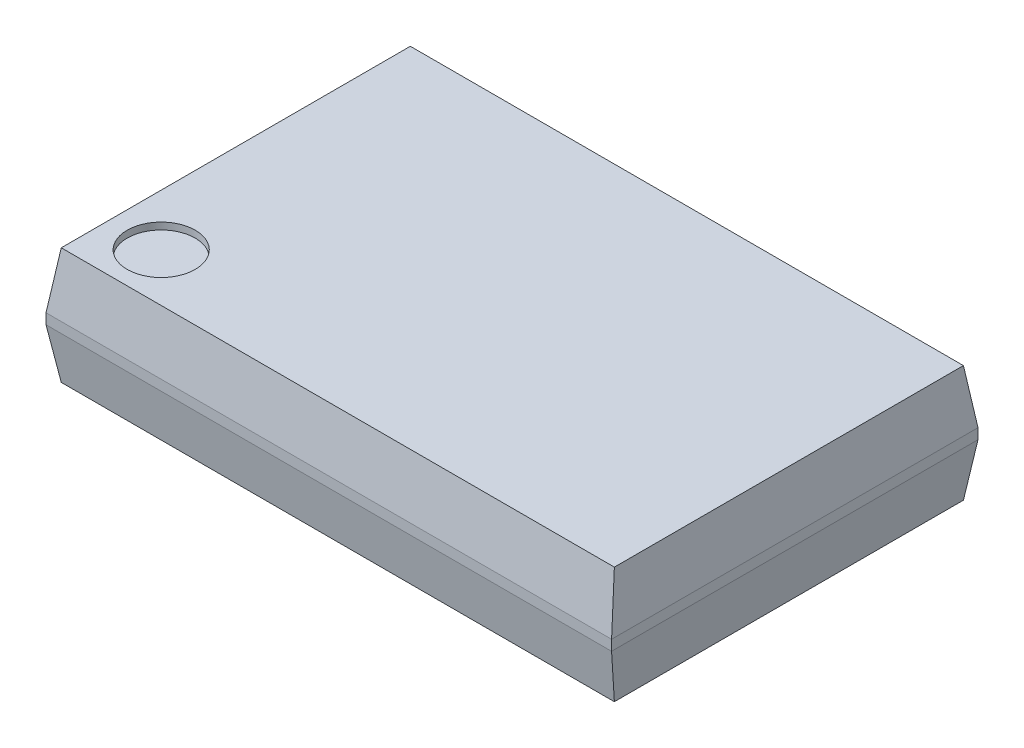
ISO-10303-21;
HEADER;
FILE_DESCRIPTION(('STEP AP214'),'2;1');
FILE_NAME('part.step','',(''),(''),'','','');
FILE_SCHEMA(('AUTOMOTIVE_DESIGN { 1 0 10303 214 1 1 1 1 }'));
ENDSEC;
DATA;
#1=APPLICATION_CONTEXT('core data for automotive mechanical design processes');
#2=APPLICATION_PROTOCOL_DEFINITION('international standard','automotive_design',2000,#1);
#3=PRODUCT_CONTEXT('',#1,'mechanical');
#4=PRODUCT('Part','Part','',(#3));
#5=PRODUCT_RELATED_PRODUCT_CATEGORY('part','',(#4));
#6=PRODUCT_DEFINITION_FORMATION('','',#4);
#7=PRODUCT_DEFINITION_CONTEXT('part definition',#1,'design');
#8=PRODUCT_DEFINITION('design','',#6,#7);
#9=PRODUCT_DEFINITION_SHAPE('','',#8);
#10=(LENGTH_UNIT() NAMED_UNIT(*) SI_UNIT(.MILLI.,.METRE.));
#11=(NAMED_UNIT(*) PLANE_ANGLE_UNIT() SI_UNIT($,.RADIAN.));
#12=(NAMED_UNIT(*) SI_UNIT($,.STERADIAN.) SOLID_ANGLE_UNIT());
#13=UNCERTAINTY_MEASURE_WITH_UNIT(LENGTH_MEASURE(1.E-05),#10,'distance_accuracy_value','');
#14=(GEOMETRIC_REPRESENTATION_CONTEXT(3) GLOBAL_UNCERTAINTY_ASSIGNED_CONTEXT((#13)) GLOBAL_UNIT_ASSIGNED_CONTEXT((#10,
#11,#12)) REPRESENTATION_CONTEXT('',''));
#15=CARTESIAN_POINT('',(0.,0.,0.));
#16=DIRECTION('',(0.,0.,1.));
#17=DIRECTION('',(1.,0.,0.));
#18=AXIS2_PLACEMENT_3D('',#15,#16,#17);
#19=CARTESIAN_POINT('',(-2.77777777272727,0.848106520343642,1.83333333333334));
#20=DIRECTION('',(0.,1.,0.));
#21=DIRECTION('',(-1.,0.,0.));
#22=AXIS2_PLACEMENT_3D('',#19,#20,#21);
#23=PLANE('',#22);
#24=CARTESIAN_POINT('',(-3.27272727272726,0.848106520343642,1.83333333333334));
#25=DIRECTION('',(0.,1.,0.));
#26=DIRECTION('',(-1.,0.,0.));
#27=AXIS2_PLACEMENT_3D('',#24,#25,#26);
#28=CIRCLE('',#27,0.49494949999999);
#29=CARTESIAN_POINT('',(-3.76767677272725,0.848106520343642,1.83333333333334));
#30=VERTEX_POINT('',#29);
#31=EDGE_CURVE('E19',#30,#30,#28,.T.);
#32=ORIENTED_EDGE('',*,*,#31,.T.);
#33=EDGE_LOOP('',(#32));
#34=FACE_BOUND('',#33,.T.);
#35=ADVANCED_FACE('F16',(#34),#23,.T.);
#36=CARTESIAN_POINT('',(-3.27272727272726,0.948106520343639,1.83333333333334));
#37=DIRECTION('',(0.,1.,0.));
#38=DIRECTION('',(-1.,0.,0.));
#39=AXIS2_PLACEMENT_3D('',#36,#37,#38);
#40=CYLINDRICAL_SURFACE('',#39,0.49494949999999);
#41=CARTESIAN_POINT('',(-3.27272727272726,0.948106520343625,1.83333333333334));
#42=DIRECTION('',(0.,1.,0.));
#43=DIRECTION('',(-1.,0.,0.));
#44=AXIS2_PLACEMENT_3D('',#41,#42,#43);
#45=CIRCLE('',#44,0.49494949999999);
#46=CARTESIAN_POINT('',(-3.76767677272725,0.948106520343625,1.83333333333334));
#47=VERTEX_POINT('',#46);
#48=EDGE_CURVE('E92',#47,#47,#45,.F.);
#49=ORIENTED_EDGE('',*,*,#48,.F.);
#50=EDGE_LOOP('',(#49));
#51=FACE_BOUND('',#50,.T.);
#52=ORIENTED_EDGE('',*,*,#31,.F.);
#53=EDGE_LOOP('',(#52));
#54=FACE_BOUND('',#53,.T.);
#55=ADVANCED_FACE('F113',(#51,#54),#40,.F.);
#56=CARTESIAN_POINT('',(-4.11614999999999,0.948106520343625,-0.00505050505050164));
#57=DIRECTION('',(0.,1.,0.));
#58=DIRECTION('',(0.,0.,1.));
#59=AXIS2_PLACEMENT_3D('',#56,#57,#58);
#60=PLANE('',#59);
#61=DIRECTION('',(0.,0.,1.));
#62=VECTOR('',#61,1.);
#63=CARTESIAN_POINT('',(4.02524090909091,0.948106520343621,-4.11615000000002));
#64=LINE('',#63,#62);
#65=CARTESIAN_POINT('',(4.02524090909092,0.948106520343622,2.53535353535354));
#66=VERTEX_POINT('',#65);
#67=CARTESIAN_POINT('',(4.02524090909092,0.94810652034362,-2.54545454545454));
#68=VERTEX_POINT('',#67);
#69=EDGE_CURVE('E79',#66,#68,#64,.F.);
#70=ORIENTED_EDGE('',*,*,#69,.T.);
#71=DIRECTION('',(1.,0.,0.));
#72=VECTOR('',#71,1.);
#73=CARTESIAN_POINT('',(-4.11614999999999,0.948106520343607,-2.54545454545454));
#74=LINE('',#73,#72);
#75=CARTESIAN_POINT('',(-4.02524090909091,0.948106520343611,-2.54545454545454));
#76=VERTEX_POINT('',#75);
#77=EDGE_CURVE('E94',#76,#68,#74,.T.);
#78=ORIENTED_EDGE('',*,*,#77,.F.);
#79=DIRECTION('',(0.,0.,1.));
#80=VECTOR('',#79,1.);
#81=CARTESIAN_POINT('',(-4.0252409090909,0.948106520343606,-4.11615000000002));
#82=LINE('',#81,#80);
#83=CARTESIAN_POINT('',(-4.02524090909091,0.948106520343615,2.53535353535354));
#84=VERTEX_POINT('',#83);
#85=EDGE_CURVE('E84',#76,#84,#82,.T.);
#86=ORIENTED_EDGE('',*,*,#85,.T.);
#87=DIRECTION('',(1.,0.,0.));
#88=VECTOR('',#87,1.);
#89=CARTESIAN_POINT('',(-4.11614999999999,0.948106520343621,2.53535353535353));
#90=LINE('',#89,#88);
#91=EDGE_CURVE('E358',#66,#84,#90,.F.);
#92=ORIENTED_EDGE('',*,*,#91,.F.);
#93=EDGE_LOOP('',(#70,#78,#86,#92));
#94=FACE_BOUND('',#93,.T.);
#95=ORIENTED_EDGE('',*,*,#48,.T.);
#96=EDGE_LOOP('',(#95));
#97=FACE_BOUND('',#96,.T.);
#98=ADVANCED_FACE('F95',(#94,#97),#60,.T.);
#99=CARTESIAN_POINT('',(-4.07069545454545,0.549116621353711,-4.11615000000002));
#100=DIRECTION('',(0.993573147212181,-0.113191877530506,0.));
#101=DIRECTION('',(0.113191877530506,0.993573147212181,0.));
#102=AXIS2_PLACEMENT_3D('',#99,#100,#101);
#103=PLANE('',#102);
#104=DIRECTION('',(0.,0.,-1.));
#105=VECTOR('',#104,1.);
#106=CARTESIAN_POINT('',(-4.11614999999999,0.150126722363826,-0.00373182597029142));
#107=LINE('',#106,#105);
#108=CARTESIAN_POINT('',(-4.11614999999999,0.150126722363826,-2.66666666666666));
#109=VERTEX_POINT('',#108);
#110=CARTESIAN_POINT('',(-4.11614999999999,0.150126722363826,2.66666666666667));
#111=VERTEX_POINT('',#110);
#112=EDGE_CURVE('E356',#109,#111,#107,.F.);
#113=ORIENTED_EDGE('',*,*,#112,.T.);
#114=DIRECTION('',(-0.111708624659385,-0.980553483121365,0.161356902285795));
#115=VECTOR('',#114,1.);
#116=CARTESIAN_POINT('',(-4.02524090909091,0.948106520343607,2.53535353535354));
#117=LINE('',#116,#115);
#118=EDGE_CURVE('E90',#84,#111,#117,.T.);
#119=ORIENTED_EDGE('',*,*,#118,.F.);
#120=ORIENTED_EDGE('',*,*,#85,.F.);
#121=DIRECTION('',(0.11192437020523,0.982447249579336,0.149232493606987));
#122=VECTOR('',#121,1.);
#123=CARTESIAN_POINT('',(-4.11614999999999,0.150126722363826,-2.66666666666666));
#124=LINE('',#123,#122);
#125=EDGE_CURVE('E87',#109,#76,#124,.T.);
#126=ORIENTED_EDGE('',*,*,#125,.F.);
#127=EDGE_LOOP('',(#113,#119,#120,#126));
#128=FACE_BOUND('',#127,.T.);
#129=ADVANCED_FACE('F85',(#128),#103,.F.);
#130=CARTESIAN_POINT('',(-4.11614999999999,0.549116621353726,-2.6060606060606));
#131=DIRECTION('',(0.,0.150176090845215,-0.988659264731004));
#132=DIRECTION('',(0.,0.988659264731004,0.150176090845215));
#133=AXIS2_PLACEMENT_3D('',#130,#131,#132);
#134=PLANE('',#133);
#135=DIRECTION('',(0.111924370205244,-0.982447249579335,-0.149232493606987));
#136=VECTOR('',#135,1.);
#137=CARTESIAN_POINT('',(4.02524090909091,0.948106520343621,-2.54545454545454));
#138=LINE('',#137,#136);
#139=CARTESIAN_POINT('',(4.11615000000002,0.150126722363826,-2.66666666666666));
#140=VERTEX_POINT('',#139);
#141=EDGE_CURVE('E339',#68,#140,#138,.T.);
#142=ORIENTED_EDGE('',*,*,#141,.T.);
#143=DIRECTION('',(-1.,0.,0.));
#144=VECTOR('',#143,1.);
#145=CARTESIAN_POINT('',(-4.11614999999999,0.150126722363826,-2.66666666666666));
#146=LINE('',#145,#144);
#147=EDGE_CURVE('E103',#109,#140,#146,.F.);
#148=ORIENTED_EDGE('',*,*,#147,.F.);
#149=ORIENTED_EDGE('',*,*,#125,.T.);
#150=ORIENTED_EDGE('',*,*,#77,.T.);
#151=EDGE_LOOP('',(#142,#148,#149,#150));
#152=FACE_BOUND('',#151,.T.);
#153=ADVANCED_FACE('F101',(#152),#134,.T.);
#154=CARTESIAN_POINT('',(4.07069545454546,0.549116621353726,-4.11615000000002));
#155=DIRECTION('',(-0.993573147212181,-0.113191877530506,0.));
#156=DIRECTION('',(0.113191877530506,-0.993573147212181,0.));
#157=AXIS2_PLACEMENT_3D('',#154,#155,#156);
#158=PLANE('',#157);
#159=DIRECTION('',(0.,0.,-1.));
#160=VECTOR('',#159,1.);
#161=CARTESIAN_POINT('',(4.11615000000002,0.150126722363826,2.66666666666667));
#162=LINE('',#161,#160);
#163=CARTESIAN_POINT('',(4.11615000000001,0.150126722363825,2.66666666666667));
#164=VERTEX_POINT('',#163);
#165=EDGE_CURVE('E337',#140,#164,#162,.F.);
#166=ORIENTED_EDGE('',*,*,#165,.F.);
#167=ORIENTED_EDGE('',*,*,#141,.F.);
#168=ORIENTED_EDGE('',*,*,#69,.F.);
#169=DIRECTION('',(-0.111708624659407,0.980553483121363,-0.161356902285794));
#170=VECTOR('',#169,1.);
#171=CARTESIAN_POINT('',(4.11615000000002,0.150126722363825,2.66666666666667));
#172=LINE('',#171,#170);
#173=EDGE_CURVE('E341',#164,#66,#172,.T.);
#174=ORIENTED_EDGE('',*,*,#173,.F.);
#175=EDGE_LOOP('',(#166,#167,#168,#174));
#176=FACE_BOUND('',#175,.T.);
#177=ADVANCED_FACE('F164',(#176),#158,.F.);
#178=CARTESIAN_POINT('',(-4.11614999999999,0.549116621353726,2.6010101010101));
#179=DIRECTION('',(0.,0.162373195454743,0.986729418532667));
#180=DIRECTION('',(0.,-0.986729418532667,0.162373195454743));
#181=AXIS2_PLACEMENT_3D('',#178,#179,#180);
#182=PLANE('',#181);
#183=ORIENTED_EDGE('',*,*,#173,.T.);
#184=ORIENTED_EDGE('',*,*,#91,.T.);
#185=ORIENTED_EDGE('',*,*,#118,.T.);
#186=DIRECTION('',(1.,0.,0.));
#187=VECTOR('',#186,1.);
#188=CARTESIAN_POINT('',(-4.11614999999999,0.150126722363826,2.66666666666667));
#189=LINE('',#188,#187);
#190=EDGE_CURVE('E376',#164,#111,#189,.F.);
#191=ORIENTED_EDGE('',*,*,#190,.F.);
#192=EDGE_LOOP('',(#183,#184,#185,#191));
#193=FACE_BOUND('',#192,.T.);
#194=ADVANCED_FACE('F160',(#193),#182,.T.);
#195=CARTESIAN_POINT('',(-4.11614999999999,0.0995384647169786,-0.00373182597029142));
#196=DIRECTION('',(1.,0.,0.));
#197=DIRECTION('',(0.,0.,-1.));
#198=AXIS2_PLACEMENT_3D('',#195,#196,#197);
#199=PLANE('',#198);
#200=DIRECTION('',(0.,1.,0.));
#201=VECTOR('',#200,1.);
#202=CARTESIAN_POINT('',(-4.11614999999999,0.0743691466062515,2.66666666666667));
#203=LINE('',#202,#201);
#204=CARTESIAN_POINT('',(-4.11615,-0.0013884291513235,2.66666666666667));
#205=VERTEX_POINT('',#204);
#206=EDGE_CURVE('E373',#111,#205,#203,.F.);
#207=ORIENTED_EDGE('',*,*,#206,.F.);
#208=ORIENTED_EDGE('',*,*,#112,.F.);
#209=DIRECTION('',(0.,1.,0.));
#210=VECTOR('',#209,1.);
#211=CARTESIAN_POINT('',(-4.11614999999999,0.0743691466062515,-2.66666666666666));
#212=LINE('',#211,#210);
#213=CARTESIAN_POINT('',(-4.11615,-0.00138842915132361,-2.66666666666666));
#214=VERTEX_POINT('',#213);
#215=EDGE_CURVE('E351',#214,#109,#212,.T.);
#216=ORIENTED_EDGE('',*,*,#215,.F.);
#217=DIRECTION('',(0.,0.,1.));
#218=VECTOR('',#217,1.);
#219=CARTESIAN_POINT('',(-4.11615000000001,-0.00138842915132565,-4.11615000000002));
#220=LINE('',#219,#218);
#221=EDGE_CURVE('E366',#214,#205,#220,.T.);
#222=ORIENTED_EDGE('',*,*,#221,.T.);
#223=EDGE_LOOP('',(#207,#208,#216,#222));
#224=FACE_BOUND('',#223,.T.);
#225=ADVANCED_FACE('F156',(#224),#199,.F.);
#226=CARTESIAN_POINT('',(-4.11614999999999,0.0743691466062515,-2.66666666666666));
#227=DIRECTION('',(0.,0.,-1.));
#228=DIRECTION('',(-1.,0.,0.));
#229=AXIS2_PLACEMENT_3D('',#226,#227,#228);
#230=PLANE('',#229);
#231=ORIENTED_EDGE('',*,*,#215,.T.);
#232=ORIENTED_EDGE('',*,*,#147,.T.);
#233=DIRECTION('',(0.,1.,0.));
#234=VECTOR('',#233,1.);
#235=CARTESIAN_POINT('',(4.11615000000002,-0.00138842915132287,-2.66666666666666));
#236=LINE('',#235,#234);
#237=CARTESIAN_POINT('',(4.11615000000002,-0.00138842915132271,-2.66666666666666));
#238=VERTEX_POINT('',#237);
#239=EDGE_CURVE('E344',#238,#140,#236,.T.);
#240=ORIENTED_EDGE('',*,*,#239,.F.);
#241=DIRECTION('',(1.,0.,0.));
#242=VECTOR('',#241,1.);
#243=CARTESIAN_POINT('',(-4.11614999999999,-0.00138842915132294,-2.66666666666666));
#244=LINE('',#243,#242);
#245=EDGE_CURVE('E362',#214,#238,#244,.T.);
#246=ORIENTED_EDGE('',*,*,#245,.F.);
#247=EDGE_LOOP('',(#231,#232,#240,#246));
#248=FACE_BOUND('',#247,.T.);
#249=ADVANCED_FACE('F152',(#248),#230,.T.);
#250=CARTESIAN_POINT('',(4.11615000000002,-0.00138842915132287,2.66666666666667));
#251=DIRECTION('',(1.,0.,0.));
#252=DIRECTION('',(0.,0.,-1.));
#253=AXIS2_PLACEMENT_3D('',#250,#251,#252);
#254=PLANE('',#253);
#255=ORIENTED_EDGE('',*,*,#165,.T.);
#256=DIRECTION('',(0.,1.,0.));
#257=VECTOR('',#256,1.);
#258=CARTESIAN_POINT('',(4.11615000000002,0.0743691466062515,2.66666666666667));
#259=LINE('',#258,#257);
#260=CARTESIAN_POINT('',(4.11615000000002,-0.00138842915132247,2.66666666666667));
#261=VERTEX_POINT('',#260);
#262=EDGE_CURVE('E343',#261,#164,#259,.T.);
#263=ORIENTED_EDGE('',*,*,#262,.F.);
#264=DIRECTION('',(0.,0.,1.));
#265=VECTOR('',#264,1.);
#266=CARTESIAN_POINT('',(4.11615000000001,-0.00138842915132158,-4.11615000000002));
#267=LINE('',#266,#265);
#268=EDGE_CURVE('E347',#261,#238,#267,.F.);
#269=ORIENTED_EDGE('',*,*,#268,.T.);
#270=ORIENTED_EDGE('',*,*,#239,.T.);
#271=EDGE_LOOP('',(#255,#263,#269,#270));
#272=FACE_BOUND('',#271,.T.);
#273=ADVANCED_FACE('F148',(#272),#254,.T.);
#274=CARTESIAN_POINT('',(-4.11614999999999,0.0743691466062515,2.66666666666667));
#275=DIRECTION('',(0.,0.,1.));
#276=DIRECTION('',(1.,0.,0.));
#277=AXIS2_PLACEMENT_3D('',#274,#275,#276);
#278=PLANE('',#277);
#279=ORIENTED_EDGE('',*,*,#206,.T.);
#280=DIRECTION('',(1.,0.,0.));
#281=VECTOR('',#280,1.);
#282=CARTESIAN_POINT('',(-4.11614999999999,-0.00138842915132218,2.66666666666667));
#283=LINE('',#282,#281);
#284=EDGE_CURVE('E384',#261,#205,#283,.F.);
#285=ORIENTED_EDGE('',*,*,#284,.F.);
#286=ORIENTED_EDGE('',*,*,#262,.T.);
#287=ORIENTED_EDGE('',*,*,#190,.T.);
#288=EDGE_LOOP('',(#279,#285,#286,#287));
#289=FACE_BOUND('',#288,.T.);
#290=ADVANCED_FACE('F144',(#289),#278,.T.);
#291=CARTESIAN_POINT('',(-4.07069545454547,-0.375125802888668,-4.11615000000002));
#292=DIRECTION('',(0.992685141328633,0.120731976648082,0.));
#293=DIRECTION('',(-0.120731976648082,0.992685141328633,0.));
#294=AXIS2_PLACEMENT_3D('',#291,#292,#293);
#295=PLANE('',#294);
#296=ORIENTED_EDGE('',*,*,#221,.F.);
#297=DIRECTION('',(-0.119197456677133,0.980067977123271,-0.158929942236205));
#298=VECTOR('',#297,1.);
#299=CARTESIAN_POINT('',(-4.02524090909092,-0.748863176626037,-2.54545454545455));
#300=LINE('',#299,#298);
#301=CARTESIAN_POINT('',(-4.02524090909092,-0.748863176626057,-2.54545454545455));
#302=VERTEX_POINT('',#301);
#303=EDGE_CURVE('E368',#302,#214,#300,.T.);
#304=ORIENTED_EDGE('',*,*,#303,.F.);
#305=DIRECTION('',(0.,0.,-1.));
#306=VECTOR('',#305,1.);
#307=CARTESIAN_POINT('',(-4.02524090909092,-0.74886317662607,-0.00505050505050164));
#308=LINE('',#307,#306);
#309=CARTESIAN_POINT('',(-4.02524090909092,-0.748863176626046,2.53535353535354));
#310=VERTEX_POINT('',#309);
#311=EDGE_CURVE('E393',#310,#302,#308,.T.);
#312=ORIENTED_EDGE('',*,*,#311,.F.);
#313=DIRECTION('',(0.118936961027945,-0.977926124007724,-0.171797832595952));
#314=VECTOR('',#313,1.);
#315=CARTESIAN_POINT('',(-4.11614999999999,-0.00138842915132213,2.66666666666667));
#316=LINE('',#315,#314);
#317=EDGE_CURVE('E371',#205,#310,#316,.T.);
#318=ORIENTED_EDGE('',*,*,#317,.F.);
#319=EDGE_LOOP('',(#296,#304,#312,#318));
#320=FACE_BOUND('',#319,.T.);
#321=ADVANCED_FACE('F140',(#320),#295,.F.);
#322=CARTESIAN_POINT('',(-4.11614999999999,-0.375125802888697,-2.6060606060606));
#323=DIRECTION('',(0.,-0.160071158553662,-0.987105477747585));
#324=DIRECTION('',(0.,0.987105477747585,-0.160071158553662));
#325=AXIS2_PLACEMENT_3D('',#322,#323,#324);
#326=PLANE('',#325);
#327=DIRECTION('',(-0.119197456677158,-0.980067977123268,0.158929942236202));
#328=VECTOR('',#327,1.);
#329=CARTESIAN_POINT('',(4.11615000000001,-0.00138842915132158,-2.66666666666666));
#330=LINE('',#329,#328);
#331=CARTESIAN_POINT('',(4.02524090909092,-0.748863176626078,-2.54545454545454));
#332=VERTEX_POINT('',#331);
#333=EDGE_CURVE('E386',#238,#332,#330,.T.);
#334=ORIENTED_EDGE('',*,*,#333,.T.);
#335=DIRECTION('',(1.,0.,0.));
#336=VECTOR('',#335,1.);
#337=CARTESIAN_POINT('',(-4.11614999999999,-0.74886317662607,-2.54545454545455));
#338=LINE('',#337,#336);
#339=EDGE_CURVE('E396',#302,#332,#338,.T.);
#340=ORIENTED_EDGE('',*,*,#339,.F.);
#341=ORIENTED_EDGE('',*,*,#303,.T.);
#342=ORIENTED_EDGE('',*,*,#245,.T.);
#343=EDGE_LOOP('',(#334,#340,#341,#342));
#344=FACE_BOUND('',#343,.T.);
#345=ADVANCED_FACE('F137',(#344),#326,.T.);
#346=CARTESIAN_POINT('',(4.07069545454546,-0.375125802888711,-4.11615000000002));
#347=DIRECTION('',(-0.992685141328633,0.120731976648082,0.));
#348=DIRECTION('',(-0.120731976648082,-0.992685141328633,0.));
#349=AXIS2_PLACEMENT_3D('',#346,#347,#348);
#350=PLANE('',#349);
#351=ORIENTED_EDGE('',*,*,#268,.F.);
#352=DIRECTION('',(0.118936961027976,0.97792612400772,0.171797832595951));
#353=VECTOR('',#352,1.);
#354=CARTESIAN_POINT('',(4.02524090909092,-0.748863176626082,2.53535353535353));
#355=LINE('',#354,#353);
#356=CARTESIAN_POINT('',(4.02524090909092,-0.748863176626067,2.53535353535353));
#357=VERTEX_POINT('',#356);
#358=EDGE_CURVE('E34',#357,#261,#355,.T.);
#359=ORIENTED_EDGE('',*,*,#358,.F.);
#360=DIRECTION('',(0.,0.,-1.));
#361=VECTOR('',#360,1.);
#362=CARTESIAN_POINT('',(4.02524090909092,-0.74886317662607,-0.00505050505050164));
#363=LINE('',#362,#361);
#364=EDGE_CURVE('E25',#332,#357,#363,.F.);
#365=ORIENTED_EDGE('',*,*,#364,.F.);
#366=ORIENTED_EDGE('',*,*,#333,.F.);
#367=EDGE_LOOP('',(#351,#359,#365,#366));
#368=FACE_BOUND('',#367,.T.);
#369=ADVANCED_FACE('F130',(#368),#350,.F.);
#370=CARTESIAN_POINT('',(-4.11614999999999,-0.375125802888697,2.6010101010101));
#371=DIRECTION('',(0.,-0.17302600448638,0.984917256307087));
#372=DIRECTION('',(0.,-0.984917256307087,-0.17302600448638));
#373=AXIS2_PLACEMENT_3D('',#370,#371,#372);
#374=PLANE('',#373);
#375=ORIENTED_EDGE('',*,*,#358,.T.);
#376=ORIENTED_EDGE('',*,*,#284,.T.);
#377=ORIENTED_EDGE('',*,*,#317,.T.);
#378=DIRECTION('',(1.,0.,0.));
#379=VECTOR('',#378,1.);
#380=CARTESIAN_POINT('',(-4.11614999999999,-0.74886317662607,2.53535353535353));
#381=LINE('',#380,#379);
#382=EDGE_CURVE('E10',#357,#310,#381,.F.);
#383=ORIENTED_EDGE('',*,*,#382,.F.);
#384=EDGE_LOOP('',(#375,#376,#377,#383));
#385=FACE_BOUND('',#384,.T.);
#386=ADVANCED_FACE('F124',(#385),#374,.T.);
#387=CARTESIAN_POINT('',(-4.11614999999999,-0.74886317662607,-0.00505050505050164));
#388=DIRECTION('',(0.,-1.,0.));
#389=DIRECTION('',(0.,0.,-1.));
#390=AXIS2_PLACEMENT_3D('',#387,#388,#389);
#391=PLANE('',#390);
#392=ORIENTED_EDGE('',*,*,#364,.T.);
#393=ORIENTED_EDGE('',*,*,#382,.T.);
#394=ORIENTED_EDGE('',*,*,#311,.T.);
#395=ORIENTED_EDGE('',*,*,#339,.T.);
#396=EDGE_LOOP('',(#392,#393,#394,#395));
#397=FACE_BOUND('',#396,.T.);
#398=ADVANCED_FACE('F122',(#397),#391,.T.);
#399=CLOSED_SHELL('',(#35,#55,#98,#129,#153,#177,#194,#225,#249,#273,#290,#321,#345,#369,#386,#398));
#400=MANIFOLD_SOLID_BREP('B1',#399);
#401=ADVANCED_BREP_SHAPE_REPRESENTATION('',(#18,#400),#14);
#402=SHAPE_DEFINITION_REPRESENTATION(#9,#401);
ENDSEC;
END-ISO-10303-21;
